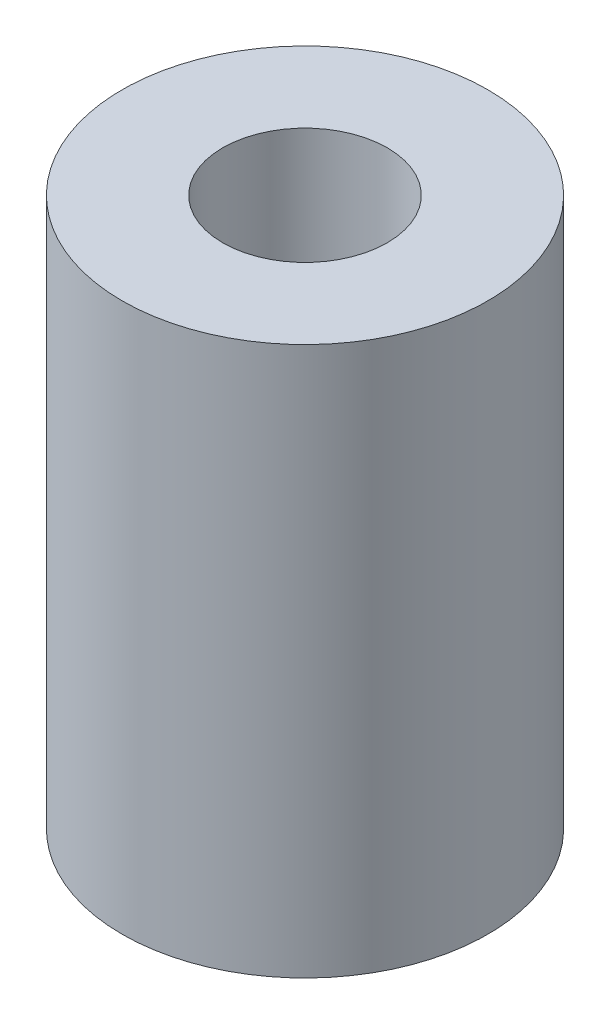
ISO-10303-21;
HEADER;
FILE_DESCRIPTION(('STEP AP214'),'2;1');
FILE_NAME('part.step','',(''),(''),'','','');
FILE_SCHEMA(('AUTOMOTIVE_DESIGN { 1 0 10303 214 1 1 1 1 }'));
ENDSEC;
DATA;
#1=APPLICATION_CONTEXT('core data for automotive mechanical design processes');
#2=APPLICATION_PROTOCOL_DEFINITION('international standard','automotive_design',2000,#1);
#3=PRODUCT_CONTEXT('',#1,'mechanical');
#4=PRODUCT('Part','Part','',(#3));
#5=PRODUCT_RELATED_PRODUCT_CATEGORY('part','',(#4));
#6=PRODUCT_DEFINITION_FORMATION('','',#4);
#7=PRODUCT_DEFINITION_CONTEXT('part definition',#1,'design');
#8=PRODUCT_DEFINITION('design','',#6,#7);
#9=PRODUCT_DEFINITION_SHAPE('','',#8);
#10=(LENGTH_UNIT() NAMED_UNIT(*) SI_UNIT(.MILLI.,.METRE.));
#11=(NAMED_UNIT(*) PLANE_ANGLE_UNIT() SI_UNIT($,.RADIAN.));
#12=(NAMED_UNIT(*) SI_UNIT($,.STERADIAN.) SOLID_ANGLE_UNIT());
#13=UNCERTAINTY_MEASURE_WITH_UNIT(LENGTH_MEASURE(1.E-05),#10,'distance_accuracy_value','');
#14=(GEOMETRIC_REPRESENTATION_CONTEXT(3) GLOBAL_UNCERTAINTY_ASSIGNED_CONTEXT((#13)) GLOBAL_UNIT_ASSIGNED_CONTEXT((#10,
#11,#12)) REPRESENTATION_CONTEXT('',''));
#15=CARTESIAN_POINT('',(0.,0.,0.));
#16=DIRECTION('',(0.,0.,1.));
#17=DIRECTION('',(1.,0.,0.));
#18=AXIS2_PLACEMENT_3D('',#15,#16,#17);
#19=CARTESIAN_POINT('',(5.,15.,0.));
#20=DIRECTION('',(0.,1.,0.));
#21=DIRECTION('',(0.,0.,1.));
#22=AXIS2_PLACEMENT_3D('',#19,#20,#21);
#23=PLANE('',#22);
#24=CARTESIAN_POINT('',(0.,15.,0.));
#25=DIRECTION('',(0.,-1.,0.));
#26=DIRECTION('',(0.,0.,-1.));
#27=AXIS2_PLACEMENT_3D('',#24,#25,#26);
#28=CIRCLE('',#27,2.25);
#29=CARTESIAN_POINT('',(0.,15.,-2.25));
#30=VERTEX_POINT('',#29);
#31=EDGE_CURVE('E51',#30,#30,#28,.T.);
#32=ORIENTED_EDGE('',*,*,#31,.T.);
#33=EDGE_LOOP('',(#32));
#34=FACE_BOUND('',#33,.T.);
#35=CARTESIAN_POINT('',(0.,15.,0.));
#36=DIRECTION('',(0.,-1.,0.));
#37=DIRECTION('',(0.,0.,-1.));
#38=AXIS2_PLACEMENT_3D('',#35,#36,#37);
#39=CIRCLE('',#38,5.);
#40=CARTESIAN_POINT('',(0.,15.,-5.));
#41=VERTEX_POINT('',#40);
#42=EDGE_CURVE('E10',#41,#41,#39,.T.);
#43=ORIENTED_EDGE('',*,*,#42,.F.);
#44=EDGE_LOOP('',(#43));
#45=FACE_BOUND('',#44,.T.);
#46=ADVANCED_FACE('F34',(#34,#45),#23,.T.);
#47=CARTESIAN_POINT('',(0.,0.,0.));
#48=DIRECTION('',(0.,-1.,0.));
#49=DIRECTION('',(0.,0.,-1.));
#50=AXIS2_PLACEMENT_3D('',#47,#48,#49);
#51=CYLINDRICAL_SURFACE('',#50,5.);
#52=ORIENTED_EDGE('',*,*,#42,.T.);
#53=EDGE_LOOP('',(#52));
#54=FACE_BOUND('',#53,.T.);
#55=CARTESIAN_POINT('',(0.,0.,0.));
#56=DIRECTION('',(0.,-1.,0.));
#57=DIRECTION('',(0.,0.,-1.));
#58=AXIS2_PLACEMENT_3D('',#55,#56,#57);
#59=CIRCLE('',#58,5.);
#60=CARTESIAN_POINT('',(0.,0.,-5.));
#61=VERTEX_POINT('',#60);
#62=EDGE_CURVE('E40',#61,#61,#59,.T.);
#63=ORIENTED_EDGE('',*,*,#62,.F.);
#64=EDGE_LOOP('',(#63));
#65=FACE_BOUND('',#64,.T.);
#66=ADVANCED_FACE('F67',(#54,#65),#51,.T.);
#67=CARTESIAN_POINT('',(2.24999999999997,0.,0.));
#68=DIRECTION('',(0.,-1.,0.));
#69=DIRECTION('',(0.,0.,-1.));
#70=AXIS2_PLACEMENT_3D('',#67,#68,#69);
#71=PLANE('',#70);
#72=ORIENTED_EDGE('',*,*,#62,.T.);
#73=EDGE_LOOP('',(#72));
#74=FACE_BOUND('',#73,.T.);
#75=CARTESIAN_POINT('',(0.,0.,0.));
#76=DIRECTION('',(0.,-1.,0.));
#77=DIRECTION('',(0.,0.,-1.));
#78=AXIS2_PLACEMENT_3D('',#75,#76,#77);
#79=CIRCLE('',#78,2.25);
#80=CARTESIAN_POINT('',(0.,0.,-2.25));
#81=VERTEX_POINT('',#80);
#82=EDGE_CURVE('E45',#81,#81,#79,.T.);
#83=ORIENTED_EDGE('',*,*,#82,.F.);
#84=EDGE_LOOP('',(#83));
#85=FACE_BOUND('',#84,.T.);
#86=ADVANCED_FACE('F61',(#74,#85),#71,.T.);
#87=CARTESIAN_POINT('',(0.,0.,0.));
#88=DIRECTION('',(0.,-1.,0.));
#89=DIRECTION('',(0.,0.,-1.));
#90=AXIS2_PLACEMENT_3D('',#87,#88,#89);
#91=CYLINDRICAL_SURFACE('',#90,2.25);
#92=ORIENTED_EDGE('',*,*,#82,.T.);
#93=EDGE_LOOP('',(#92));
#94=FACE_BOUND('',#93,.T.);
#95=ORIENTED_EDGE('',*,*,#31,.F.);
#96=EDGE_LOOP('',(#95));
#97=FACE_BOUND('',#96,.T.);
#98=ADVANCED_FACE('F59',(#94,#97),#91,.F.);
#99=CLOSED_SHELL('',(#46,#66,#86,#98));
#100=MANIFOLD_SOLID_BREP('B2',#99);
#101=ADVANCED_BREP_SHAPE_REPRESENTATION('',(#18,#100),#14);
#102=SHAPE_DEFINITION_REPRESENTATION(#9,#101);
ENDSEC;
END-ISO-10303-21;
